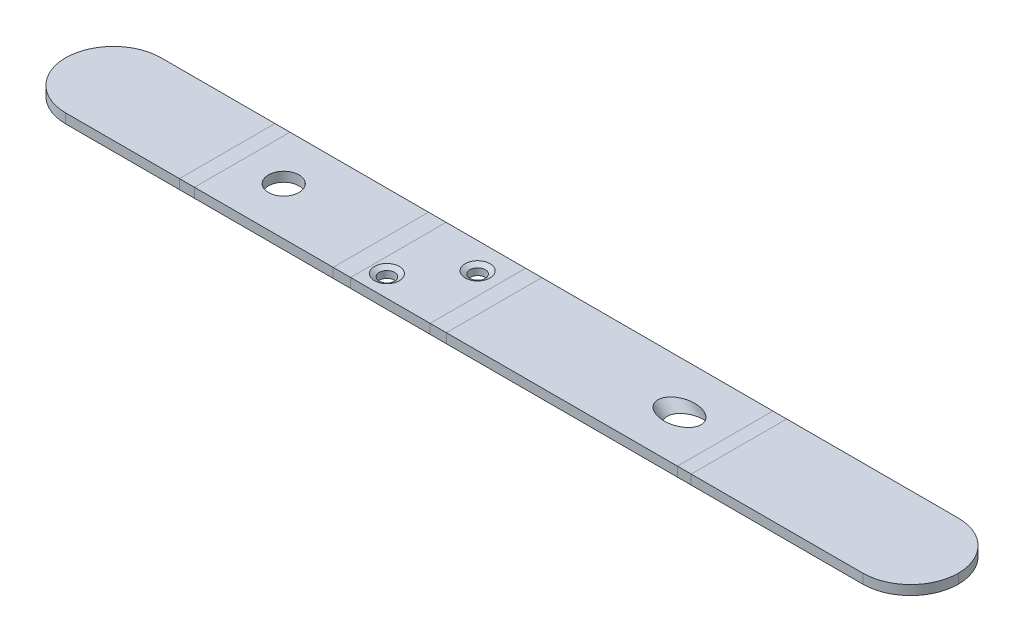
ISO-10303-21;
HEADER;
FILE_DESCRIPTION(('STEP AP214'),'2;1');
FILE_NAME('part.step','',(''),(''),'','','');
FILE_SCHEMA(('AUTOMOTIVE_DESIGN { 1 0 10303 214 1 1 1 1 }'));
ENDSEC;
DATA;
#1=APPLICATION_CONTEXT('core data for automotive mechanical design processes');
#2=APPLICATION_PROTOCOL_DEFINITION('international standard','automotive_design',2000,#1);
#3=PRODUCT_CONTEXT('',#1,'mechanical');
#4=PRODUCT('Part','Part','',(#3));
#5=PRODUCT_RELATED_PRODUCT_CATEGORY('part','',(#4));
#6=PRODUCT_DEFINITION_FORMATION('','',#4);
#7=PRODUCT_DEFINITION_CONTEXT('part definition',#1,'design');
#8=PRODUCT_DEFINITION('design','',#6,#7);
#9=PRODUCT_DEFINITION_SHAPE('','',#8);
#10=(LENGTH_UNIT() NAMED_UNIT(*) SI_UNIT(.MILLI.,.METRE.));
#11=(NAMED_UNIT(*) PLANE_ANGLE_UNIT() SI_UNIT($,.RADIAN.));
#12=(NAMED_UNIT(*) SI_UNIT($,.STERADIAN.) SOLID_ANGLE_UNIT());
#13=UNCERTAINTY_MEASURE_WITH_UNIT(LENGTH_MEASURE(1.E-05),#10,'distance_accuracy_value','');
#14=(GEOMETRIC_REPRESENTATION_CONTEXT(3) GLOBAL_UNCERTAINTY_ASSIGNED_CONTEXT((#13)) GLOBAL_UNIT_ASSIGNED_CONTEXT((#10,
#11,#12)) REPRESENTATION_CONTEXT('',''));
#15=CARTESIAN_POINT('',(0.,0.,0.));
#16=DIRECTION('',(0.,0.,1.));
#17=DIRECTION('',(1.,0.,0.));
#18=AXIS2_PLACEMENT_3D('',#15,#16,#17);
#19=CARTESIAN_POINT('',(0.,0.,20.));
#20=DIRECTION('',(0.,-1.,0.));
#21=DIRECTION('',(1.,0.,0.));
#22=AXIS2_PLACEMENT_3D('',#19,#20,#21);
#23=PLANE('',#22);
#24=CARTESIAN_POINT('',(-7.09958492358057,0.,5.5));
#25=DIRECTION('',(0.,1.,0.));
#26=DIRECTION('',(-1.,0.,0.));
#27=AXIS2_PLACEMENT_3D('',#24,#25,#26);
#28=CIRCLE('',#27,1.6);
#29=CARTESIAN_POINT('',(-8.69958492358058,0.,5.5));
#30=VERTEX_POINT('',#29);
#31=EDGE_CURVE('E392',#30,#30,#28,.T.);
#32=ORIENTED_EDGE('',*,*,#31,.T.);
#33=EDGE_LOOP('',(#32));
#34=FACE_BOUND('',#33,.T.);
#35=CARTESIAN_POINT('',(-16.0995849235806,0.,15.5));
#36=DIRECTION('',(0.,1.,0.));
#37=DIRECTION('',(-1.,0.,0.));
#38=AXIS2_PLACEMENT_3D('',#35,#36,#37);
#39=CIRCLE('',#38,1.6);
#40=CARTESIAN_POINT('',(-17.6995849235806,0.,15.5));
#41=VERTEX_POINT('',#40);
#42=EDGE_CURVE('E395',#41,#41,#39,.T.);
#43=ORIENTED_EDGE('',*,*,#42,.T.);
#44=EDGE_LOOP('',(#43));
#45=FACE_BOUND('',#44,.T.);
#46=DIRECTION('',(-1.,0.,0.));
#47=VECTOR('',#46,1.);
#48=CARTESIAN_POINT('',(0.,0.,20.));
#49=LINE('',#48,#47);
#50=CARTESIAN_POINT('',(-2.54828104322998,0.,20.));
#51=VERTEX_POINT('',#50);
#52=CARTESIAN_POINT('',(-19.1991698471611,0.,20.));
#53=VERTEX_POINT('',#52);
#54=EDGE_CURVE('E401',#51,#53,#49,.T.);
#55=ORIENTED_EDGE('',*,*,#54,.T.);
#56=DIRECTION('',(0.,0.,-1.));
#57=VECTOR('',#56,1.);
#58=CARTESIAN_POINT('',(-19.1991698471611,0.,0.));
#59=LINE('',#58,#57);
#60=CARTESIAN_POINT('',(-19.1991698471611,0.,0.));
#61=VERTEX_POINT('',#60);
#62=EDGE_CURVE('E420',#53,#61,#59,.T.);
#63=ORIENTED_EDGE('',*,*,#62,.T.);
#64=DIRECTION('',(-1.,0.,0.));
#65=VECTOR('',#64,1.);
#66=CARTESIAN_POINT('',(0.,0.,0.));
#67=LINE('',#66,#65);
#68=CARTESIAN_POINT('',(-2.54828104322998,0.,0.));
#69=VERTEX_POINT('',#68);
#70=EDGE_CURVE('E398',#69,#61,#67,.T.);
#71=ORIENTED_EDGE('',*,*,#70,.F.);
#72=DIRECTION('',(0.,0.,1.));
#73=VECTOR('',#72,1.);
#74=CARTESIAN_POINT('',(-2.54828104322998,0.,20.));
#75=LINE('',#74,#73);
#76=EDGE_CURVE('E430',#69,#51,#75,.T.);
#77=ORIENTED_EDGE('',*,*,#76,.T.);
#78=EDGE_LOOP('',(#55,#63,#71,#77));
#79=FACE_BOUND('',#78,.T.);
#80=ADVANCED_FACE('F40',(#34,#45,#79),#23,.T.);
#81=CARTESIAN_POINT('',(0.,2.,20.));
#82=DIRECTION('',(0.,-1.,0.));
#83=DIRECTION('',(1.,0.,0.));
#84=AXIS2_PLACEMENT_3D('',#81,#82,#83);
#85=PLANE('',#84);
#86=CARTESIAN_POINT('',(-16.0995849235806,2.,15.5));
#87=DIRECTION('',(0.,-1.,0.));
#88=DIRECTION('',(1.,0.,0.));
#89=AXIS2_PLACEMENT_3D('',#86,#87,#88);
#90=CIRCLE('',#89,2.60000000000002);
#91=CARTESIAN_POINT('',(-13.4995849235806,2.,15.5));
#92=VERTEX_POINT('',#91);
#93=EDGE_CURVE('E410',#92,#92,#90,.T.);
#94=ORIENTED_EDGE('',*,*,#93,.T.);
#95=EDGE_LOOP('',(#94));
#96=FACE_BOUND('',#95,.T.);
#97=CARTESIAN_POINT('',(-7.09958492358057,2.,5.5));
#98=DIRECTION('',(0.,-1.,0.));
#99=DIRECTION('',(1.,0.,0.));
#100=AXIS2_PLACEMENT_3D('',#97,#98,#99);
#101=CIRCLE('',#100,2.59999999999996);
#102=CARTESIAN_POINT('',(-4.49958492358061,2.,5.5));
#103=VERTEX_POINT('',#102);
#104=EDGE_CURVE('E407',#103,#103,#101,.T.);
#105=ORIENTED_EDGE('',*,*,#104,.T.);
#106=EDGE_LOOP('',(#105));
#107=FACE_BOUND('',#106,.T.);
#108=DIRECTION('',(0.,0.,-1.));
#109=VECTOR('',#108,1.);
#110=CARTESIAN_POINT('',(-19.1991698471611,2.,0.));
#111=LINE('',#110,#109);
#112=CARTESIAN_POINT('',(-19.1991698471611,1.99999998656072,20.));
#113=VERTEX_POINT('',#112);
#114=CARTESIAN_POINT('',(-19.1991698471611,1.99999998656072,0.));
#115=VERTEX_POINT('',#114);
#116=EDGE_CURVE('E416',#113,#115,#111,.T.);
#117=ORIENTED_EDGE('',*,*,#116,.F.);
#118=DIRECTION('',(-1.,0.,0.));
#119=VECTOR('',#118,1.);
#120=CARTESIAN_POINT('',(0.,2.,20.));
#121=LINE('',#120,#119);
#122=CARTESIAN_POINT('',(-2.54828104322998,2.00000000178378,20.));
#123=VERTEX_POINT('',#122);
#124=EDGE_CURVE('E389',#123,#113,#121,.T.);
#125=ORIENTED_EDGE('',*,*,#124,.F.);
#126=DIRECTION('',(0.,0.,1.));
#127=VECTOR('',#126,1.);
#128=CARTESIAN_POINT('',(-2.54828104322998,2.,20.));
#129=LINE('',#128,#127);
#130=CARTESIAN_POINT('',(-2.54828104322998,2.00000000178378,0.));
#131=VERTEX_POINT('',#130);
#132=EDGE_CURVE('E426',#131,#123,#129,.T.);
#133=ORIENTED_EDGE('',*,*,#132,.F.);
#134=DIRECTION('',(-1.,0.,0.));
#135=VECTOR('',#134,1.);
#136=CARTESIAN_POINT('',(0.,2.,0.));
#137=LINE('',#136,#135);
#138=EDGE_CURVE('E386',#131,#115,#137,.T.);
#139=ORIENTED_EDGE('',*,*,#138,.T.);
#140=EDGE_LOOP('',(#117,#125,#133,#139));
#141=FACE_BOUND('',#140,.T.);
#142=ADVANCED_FACE('F492',(#96,#107,#141),#85,.F.);
#143=CARTESIAN_POINT('',(-16.0995849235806,0.,15.5));
#144=DIRECTION('',(0.,1.,0.));
#145=DIRECTION('',(-1.,0.,0.));
#146=AXIS2_PLACEMENT_3D('',#143,#144,#145);
#147=CYLINDRICAL_SURFACE('',#146,1.6);
#148=CARTESIAN_POINT('',(-16.0995849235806,1.42264973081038,15.5));
#149=DIRECTION('',(0.,-1.,0.));
#150=DIRECTION('',(0.,0.,-1.));
#151=AXIS2_PLACEMENT_3D('',#148,#149,#150);
#152=CIRCLE('',#151,1.6);
#153=CARTESIAN_POINT('',(-16.0995849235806,1.42264973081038,13.9));
#154=VERTEX_POINT('',#153);
#155=EDGE_CURVE('E404',#154,#154,#152,.F.);
#156=ORIENTED_EDGE('',*,*,#155,.T.);
#157=EDGE_LOOP('',(#156));
#158=FACE_BOUND('',#157,.T.);
#159=ORIENTED_EDGE('',*,*,#42,.F.);
#160=EDGE_LOOP('',(#159));
#161=FACE_BOUND('',#160,.T.);
#162=ADVANCED_FACE('F573',(#158,#161),#147,.F.);
#163=CARTESIAN_POINT('',(-7.09958492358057,0.,5.5));
#164=DIRECTION('',(0.,1.,0.));
#165=DIRECTION('',(-1.,0.,0.));
#166=AXIS2_PLACEMENT_3D('',#163,#164,#165);
#167=CYLINDRICAL_SURFACE('',#166,1.6);
#168=CARTESIAN_POINT('',(-7.09958492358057,1.4226497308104,5.5));
#169=DIRECTION('',(0.,-1.,0.));
#170=DIRECTION('',(0.,0.,-1.));
#171=AXIS2_PLACEMENT_3D('',#168,#169,#170);
#172=CIRCLE('',#171,1.6);
#173=CARTESIAN_POINT('',(-7.09958492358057,1.4226497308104,3.9));
#174=VERTEX_POINT('',#173);
#175=EDGE_CURVE('E413',#174,#174,#172,.F.);
#176=ORIENTED_EDGE('',*,*,#175,.T.);
#177=EDGE_LOOP('',(#176));
#178=FACE_BOUND('',#177,.T.);
#179=ORIENTED_EDGE('',*,*,#31,.F.);
#180=EDGE_LOOP('',(#179));
#181=FACE_BOUND('',#180,.T.);
#182=ADVANCED_FACE('F576',(#178,#181),#167,.F.);
#183=CARTESIAN_POINT('',(0.,54.0481353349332,0.));
#184=DIRECTION('',(0.,0.,1.));
#185=DIRECTION('',(1.,0.,0.));
#186=AXIS2_PLACEMENT_3D('',#183,#184,#185);
#187=PLANE('',#186);
#188=ORIENTED_EDGE('',*,*,#70,.T.);
#189=DIRECTION('',(0.,-1.,0.));
#190=VECTOR('',#189,1.);
#191=CARTESIAN_POINT('',(-19.1991698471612,54.0481353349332,0.));
#192=LINE('',#191,#190);
#193=EDGE_CURVE('E418',#115,#61,#192,.T.);
#194=ORIENTED_EDGE('',*,*,#193,.F.);
#195=ORIENTED_EDGE('',*,*,#138,.F.);
#196=DIRECTION('',(0.,-1.,0.));
#197=VECTOR('',#196,1.);
#198=CARTESIAN_POINT('',(-2.54828104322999,54.0481353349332,0.));
#199=LINE('',#198,#197);
#200=EDGE_CURVE('E433',#131,#69,#199,.T.);
#201=ORIENTED_EDGE('',*,*,#200,.T.);
#202=EDGE_LOOP('',(#188,#194,#195,#201));
#203=FACE_BOUND('',#202,.T.);
#204=ADVANCED_FACE('F42',(#203),#187,.F.);
#205=CARTESIAN_POINT('',(0.,54.0481353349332,20.));
#206=DIRECTION('',(0.,0.,1.));
#207=DIRECTION('',(1.,0.,0.));
#208=AXIS2_PLACEMENT_3D('',#205,#206,#207);
#209=PLANE('',#208);
#210=DIRECTION('',(0.,-1.,0.));
#211=VECTOR('',#210,1.);
#212=CARTESIAN_POINT('',(-19.1991698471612,54.0481353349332,20.));
#213=LINE('',#212,#211);
#214=EDGE_CURVE('E423',#113,#53,#213,.T.);
#215=ORIENTED_EDGE('',*,*,#214,.T.);
#216=ORIENTED_EDGE('',*,*,#54,.F.);
#217=DIRECTION('',(0.,-1.,0.));
#218=VECTOR('',#217,1.);
#219=CARTESIAN_POINT('',(-2.54828104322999,54.0481353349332,20.));
#220=LINE('',#219,#218);
#221=EDGE_CURVE('E428',#123,#51,#220,.T.);
#222=ORIENTED_EDGE('',*,*,#221,.F.);
#223=ORIENTED_EDGE('',*,*,#124,.T.);
#224=EDGE_LOOP('',(#215,#216,#222,#223));
#225=FACE_BOUND('',#224,.T.);
#226=ADVANCED_FACE('F477',(#225),#209,.T.);
#227=CARTESIAN_POINT('',(-16.0995849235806,1.42264973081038,15.5));
#228=DIRECTION('',(0.,1.,0.));
#229=DIRECTION('',(0.,0.,1.));
#230=AXIS2_PLACEMENT_3D('',#227,#228,#229);
#231=CONICAL_SURFACE('',#230,1.6,1.04719755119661);
#232=ORIENTED_EDGE('',*,*,#93,.F.);
#233=EDGE_LOOP('',(#232));
#234=FACE_BOUND('',#233,.T.);
#235=ORIENTED_EDGE('',*,*,#155,.F.);
#236=EDGE_LOOP('',(#235));
#237=FACE_BOUND('',#236,.T.);
#238=ADVANCED_FACE('F583',(#234,#237),#231,.F.);
#239=CARTESIAN_POINT('',(-7.09958492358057,1.4226497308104,5.5));
#240=DIRECTION('',(0.,1.,0.));
#241=DIRECTION('',(0.,0.,1.));
#242=AXIS2_PLACEMENT_3D('',#239,#240,#241);
#243=CONICAL_SURFACE('',#242,1.6,1.04719755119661);
#244=ORIENTED_EDGE('',*,*,#104,.F.);
#245=EDGE_LOOP('',(#244));
#246=FACE_BOUND('',#245,.T.);
#247=ORIENTED_EDGE('',*,*,#175,.F.);
#248=EDGE_LOOP('',(#247));
#249=FACE_BOUND('',#248,.T.);
#250=ADVANCED_FACE('F589',(#246,#249),#243,.F.);
#251=CARTESIAN_POINT('',(-19.1991698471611,1.99999998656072,0.));
#252=DIRECTION('',(0.,0.,-1.));
#253=DIRECTION('',(-1.,0.,0.));
#254=AXIS2_PLACEMENT_3D('',#251,#252,#253);
#255=PLANE('',#254);
#256=ORIENTED_EDGE('',*,*,#193,.T.);
#257=DIRECTION('',(-1.,0.,0.));
#258=VECTOR('',#257,1.);
#259=CARTESIAN_POINT('',(-21.0317655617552,0.,0.));
#260=LINE('',#259,#258);
#261=CARTESIAN_POINT('',(-22.8643612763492,-1.3439284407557E-08,8.84278526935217E-10));
#262=VERTEX_POINT('',#261);
#263=EDGE_CURVE('E291',#61,#262,#260,.T.);
#264=ORIENTED_EDGE('',*,*,#263,.T.);
#265=DIRECTION('',(0.,-1.,0.));
#266=VECTOR('',#265,1.);
#267=CARTESIAN_POINT('',(-22.8643612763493,72.5288932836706,8.84278526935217E-10));
#268=LINE('',#267,#266);
#269=CARTESIAN_POINT('',(-22.8643612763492,1.99999998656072,8.84278526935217E-10));
#270=VERTEX_POINT('',#269);
#271=EDGE_CURVE('E300',#270,#262,#268,.T.);
#272=ORIENTED_EDGE('',*,*,#271,.F.);
#273=DIRECTION('',(-1.,0.,0.));
#274=VECTOR('',#273,1.);
#275=CARTESIAN_POINT('',(-19.1991698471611,1.99999998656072,0.));
#276=LINE('',#275,#274);
#277=EDGE_CURVE('E380',#115,#270,#276,.T.);
#278=ORIENTED_EDGE('',*,*,#277,.F.);
#279=EDGE_LOOP('',(#256,#264,#272,#278));
#280=FACE_BOUND('',#279,.T.);
#281=ADVANCED_FACE('F500',(#280),#255,.T.);
#282=CARTESIAN_POINT('',(-22.8643612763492,1.99999998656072,20.));
#283=DIRECTION('',(0.,0.,1.));
#284=DIRECTION('',(1.,0.,0.));
#285=AXIS2_PLACEMENT_3D('',#282,#283,#284);
#286=PLANE('',#285);
#287=DIRECTION('',(-1.,0.,0.));
#288=VECTOR('',#287,1.);
#289=CARTESIAN_POINT('',(-21.0317655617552,0.,20.));
#290=LINE('',#289,#288);
#291=CARTESIAN_POINT('',(-22.8643612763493,-1.3439287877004E-08,20.0000000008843));
#292=VERTEX_POINT('',#291);
#293=EDGE_CURVE('E378',#292,#53,#290,.F.);
#294=ORIENTED_EDGE('',*,*,#293,.T.);
#295=ORIENTED_EDGE('',*,*,#214,.F.);
#296=DIRECTION('',(1.,0.,0.));
#297=VECTOR('',#296,1.);
#298=CARTESIAN_POINT('',(-22.8643612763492,1.99999998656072,20.));
#299=LINE('',#298,#297);
#300=CARTESIAN_POINT('',(-22.8643612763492,1.99999998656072,20.));
#301=VERTEX_POINT('',#300);
#302=EDGE_CURVE('E383',#301,#113,#299,.T.);
#303=ORIENTED_EDGE('',*,*,#302,.F.);
#304=DIRECTION('',(0.,-1.,0.));
#305=VECTOR('',#304,1.);
#306=CARTESIAN_POINT('',(-22.8643612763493,72.5288932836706,20.0000000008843));
#307=LINE('',#306,#305);
#308=EDGE_CURVE('E287',#301,#292,#307,.T.);
#309=ORIENTED_EDGE('',*,*,#308,.T.);
#310=EDGE_LOOP('',(#294,#295,#303,#309));
#311=FACE_BOUND('',#310,.T.);
#312=ADVANCED_FACE('F516',(#311),#286,.T.);
#313=CARTESIAN_POINT('',(-21.0317655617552,2.,10.));
#314=DIRECTION('',(0.,1.,0.));
#315=DIRECTION('',(-1.,0.,0.));
#316=AXIS2_PLACEMENT_3D('',#313,#314,#315);
#317=PLANE('',#316);
#318=DIRECTION('',(0.,0.,-1.));
#319=VECTOR('',#318,1.);
#320=CARTESIAN_POINT('',(-22.8643612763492,1.99999998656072,8.84278526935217E-10));
#321=LINE('',#320,#319);
#322=EDGE_CURVE('E306',#301,#270,#321,.T.);
#323=ORIENTED_EDGE('',*,*,#322,.F.);
#324=ORIENTED_EDGE('',*,*,#302,.T.);
#325=ORIENTED_EDGE('',*,*,#116,.T.);
#326=ORIENTED_EDGE('',*,*,#277,.T.);
#327=EDGE_LOOP('',(#323,#324,#325,#326));
#328=FACE_BOUND('',#327,.T.);
#329=ADVANCED_FACE('F496',(#328),#317,.T.);
#330=CARTESIAN_POINT('',(-21.0317655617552,0.,10.));
#331=DIRECTION('',(0.,1.,0.));
#332=DIRECTION('',(-1.,0.,0.));
#333=AXIS2_PLACEMENT_3D('',#330,#331,#332);
#334=PLANE('',#333);
#335=DIRECTION('',(0.,0.,-1.));
#336=VECTOR('',#335,1.);
#337=CARTESIAN_POINT('',(-22.8643612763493,-1.3439287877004E-08,8.84278526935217E-10));
#338=LINE('',#337,#336);
#339=EDGE_CURVE('E371',#292,#262,#338,.T.);
#340=ORIENTED_EDGE('',*,*,#339,.T.);
#341=ORIENTED_EDGE('',*,*,#263,.F.);
#342=ORIENTED_EDGE('',*,*,#62,.F.);
#343=ORIENTED_EDGE('',*,*,#293,.F.);
#344=EDGE_LOOP('',(#340,#341,#342,#343));
#345=FACE_BOUND('',#344,.T.);
#346=ADVANCED_FACE('F511',(#345),#334,.F.);
#347=CARTESIAN_POINT('',(-78.8957227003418,-76.625804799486,10.0000000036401));
#348=DIRECTION('',(0.,1.,0.));
#349=DIRECTION('',(-1.,0.,0.));
#350=AXIS2_PLACEMENT_3D('',#347,#348,#349);
#351=CYLINDRICAL_SURFACE('',#350,10.);
#352=DIRECTION('',(0.,1.,0.));
#353=VECTOR('',#352,1.);
#354=CARTESIAN_POINT('',(-78.8957227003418,-76.625804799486,20.0000000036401));
#355=LINE('',#354,#353);
#356=CARTESIAN_POINT('',(-78.8957227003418,1.41192543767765E-08,20.0000000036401));
#357=VERTEX_POINT('',#356);
#358=CARTESIAN_POINT('',(-78.8957227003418,2.00000001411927,20.0000000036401));
#359=VERTEX_POINT('',#358);
#360=EDGE_CURVE('E368',#357,#359,#355,.T.);
#361=ORIENTED_EDGE('',*,*,#360,.T.);
#362=CARTESIAN_POINT('',(-78.8957227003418,2.00000001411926,10.0000000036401));
#363=DIRECTION('',(0.,-1.,0.));
#364=DIRECTION('',(1.,0.,0.));
#365=AXIS2_PLACEMENT_3D('',#362,#363,#364);
#366=CIRCLE('',#365,10.);
#367=CARTESIAN_POINT('',(-88.8957227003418,2.00000001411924,10.0000000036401));
#368=VERTEX_POINT('',#367);
#369=EDGE_CURVE('E339',#368,#359,#366,.F.);
#370=ORIENTED_EDGE('',*,*,#369,.F.);
#371=DIRECTION('',(0.,1.,0.));
#372=VECTOR('',#371,1.);
#373=CARTESIAN_POINT('',(-88.8957227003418,-76.625804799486,10.0000000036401));
#374=LINE('',#373,#372);
#375=CARTESIAN_POINT('',(-88.8957227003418,1.41192543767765E-08,10.0000000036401));
#376=VERTEX_POINT('',#375);
#377=EDGE_CURVE('E365',#376,#368,#374,.T.);
#378=ORIENTED_EDGE('',*,*,#377,.F.);
#379=CARTESIAN_POINT('',(-78.8957227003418,1.41192439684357E-08,10.0000000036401));
#380=DIRECTION('',(0.,-1.,0.));
#381=DIRECTION('',(1.,0.,0.));
#382=AXIS2_PLACEMENT_3D('',#379,#380,#381);
#383=CIRCLE('',#382,10.);
#384=EDGE_CURVE('E357',#357,#376,#383,.T.);
#385=ORIENTED_EDGE('',*,*,#384,.F.);
#386=EDGE_LOOP('',(#361,#370,#378,#385));
#387=FACE_BOUND('',#386,.T.);
#388=ADVANCED_FACE('F554',(#387),#351,.T.);
#389=CARTESIAN_POINT('',(-78.8957227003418,-76.625804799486,10.0000000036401));
#390=DIRECTION('',(0.,1.,0.));
#391=DIRECTION('',(-1.,0.,0.));
#392=AXIS2_PLACEMENT_3D('',#389,#390,#391);
#393=CYLINDRICAL_SURFACE('',#392,10.);
#394=ORIENTED_EDGE('',*,*,#377,.T.);
#395=CARTESIAN_POINT('',(-78.8957227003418,2.00000001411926,10.0000000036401));
#396=DIRECTION('',(0.,-1.,0.));
#397=DIRECTION('',(1.,0.,0.));
#398=AXIS2_PLACEMENT_3D('',#395,#396,#397);
#399=CIRCLE('',#398,10.);
#400=CARTESIAN_POINT('',(-78.8957227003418,2.00000001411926,3.64012240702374E-09));
#401=VERTEX_POINT('',#400);
#402=EDGE_CURVE('E342',#401,#368,#399,.F.);
#403=ORIENTED_EDGE('',*,*,#402,.F.);
#404=DIRECTION('',(0.,1.,0.));
#405=VECTOR('',#404,1.);
#406=CARTESIAN_POINT('',(-78.8957227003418,-76.625804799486,3.64012240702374E-09));
#407=LINE('',#406,#405);
#408=CARTESIAN_POINT('',(-78.8957227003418,1.41192509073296E-08,3.64012240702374E-09));
#409=VERTEX_POINT('',#408);
#410=EDGE_CURVE('E350',#409,#401,#407,.T.);
#411=ORIENTED_EDGE('',*,*,#410,.F.);
#412=CARTESIAN_POINT('',(-78.8957227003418,1.41192439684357E-08,10.0000000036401));
#413=DIRECTION('',(0.,-1.,0.));
#414=DIRECTION('',(1.,0.,0.));
#415=AXIS2_PLACEMENT_3D('',#412,#413,#414);
#416=CIRCLE('',#415,10.);
#417=EDGE_CURVE('E355',#376,#409,#416,.T.);
#418=ORIENTED_EDGE('',*,*,#417,.F.);
#419=EDGE_LOOP('',(#394,#403,#411,#418));
#420=FACE_BOUND('',#419,.T.);
#421=ADVANCED_FACE('F557',(#420),#393,.T.);
#422=CARTESIAN_POINT('',(-53.8957227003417,-76.625804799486,20.0000000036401));
#423=DIRECTION('',(0.,0.,-1.));
#424=DIRECTION('',(-1.,0.,0.));
#425=AXIS2_PLACEMENT_3D('',#422,#423,#424);
#426=PLANE('',#425);
#427=DIRECTION('',(0.,1.,0.));
#428=VECTOR('',#427,1.);
#429=CARTESIAN_POINT('',(-55.050423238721,-76.625804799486,20.0000000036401));
#430=LINE('',#429,#428);
#431=CARTESIAN_POINT('',(-55.050423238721,1.41192647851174E-08,20.0000000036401));
#432=VERTEX_POINT('',#431);
#433=CARTESIAN_POINT('',(-55.050423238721,2.00000001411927,20.0000000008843));
#434=VERTEX_POINT('',#433);
#435=EDGE_CURVE('E363',#432,#434,#430,.T.);
#436=ORIENTED_EDGE('',*,*,#435,.T.);
#437=DIRECTION('',(-1.,0.,0.));
#438=VECTOR('',#437,1.);
#439=CARTESIAN_POINT('',(-53.8957227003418,2.00000001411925,20.0000000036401));
#440=LINE('',#439,#438);
#441=EDGE_CURVE('E361',#434,#359,#440,.T.);
#442=ORIENTED_EDGE('',*,*,#441,.T.);
#443=ORIENTED_EDGE('',*,*,#360,.F.);
#444=DIRECTION('',(-1.,0.,0.));
#445=VECTOR('',#444,1.);
#446=CARTESIAN_POINT('',(-53.8957227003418,1.41192613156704E-08,20.0000000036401));
#447=LINE('',#446,#445);
#448=EDGE_CURVE('E359',#432,#357,#447,.T.);
#449=ORIENTED_EDGE('',*,*,#448,.F.);
#450=EDGE_LOOP('',(#436,#442,#443,#449));
#451=FACE_BOUND('',#450,.T.);
#452=ADVANCED_FACE('F547',(#451),#426,.F.);
#453=CARTESIAN_POINT('',(-53.8957227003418,1.41192613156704E-08,20.0000000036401));
#454=DIRECTION('',(0.,-1.,0.));
#455=DIRECTION('',(1.,0.,0.));
#456=AXIS2_PLACEMENT_3D('',#453,#454,#455);
#457=PLANE('',#456);
#458=DIRECTION('',(0.,0.,-1.));
#459=VECTOR('',#458,1.);
#460=CARTESIAN_POINT('',(-55.050423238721,1.41192370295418E-08,20.0000000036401));
#461=LINE('',#460,#459);
#462=CARTESIAN_POINT('',(-55.050423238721,1.41192647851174E-08,3.64012240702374E-09));
#463=VERTEX_POINT('',#462);
#464=EDGE_CURVE('E331',#432,#463,#461,.T.);
#465=ORIENTED_EDGE('',*,*,#464,.F.);
#466=ORIENTED_EDGE('',*,*,#448,.T.);
#467=ORIENTED_EDGE('',*,*,#384,.T.);
#468=ORIENTED_EDGE('',*,*,#417,.T.);
#469=DIRECTION('',(-1.,0.,0.));
#470=VECTOR('',#469,1.);
#471=CARTESIAN_POINT('',(-53.8957227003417,1.41192370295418E-08,3.64012240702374E-09));
#472=LINE('',#471,#470);
#473=EDGE_CURVE('E352',#463,#409,#472,.T.);
#474=ORIENTED_EDGE('',*,*,#473,.F.);
#475=EDGE_LOOP('',(#465,#466,#467,#468,#474));
#476=FACE_BOUND('',#475,.T.);
#477=ADVANCED_FACE('F541',(#476),#457,.T.);
#478=CARTESIAN_POINT('',(-53.8957227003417,-76.625804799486,3.64012240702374E-09));
#479=DIRECTION('',(0.,0.,-1.));
#480=DIRECTION('',(-1.,0.,0.));
#481=AXIS2_PLACEMENT_3D('',#478,#479,#480);
#482=PLANE('',#481);
#483=DIRECTION('',(-1.,0.,0.));
#484=VECTOR('',#483,1.);
#485=CARTESIAN_POINT('',(-53.8957227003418,2.00000001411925,3.64012240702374E-09));
#486=LINE('',#485,#484);
#487=CARTESIAN_POINT('',(-55.050423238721,2.00000001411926,3.64012240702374E-09));
#488=VERTEX_POINT('',#487);
#489=EDGE_CURVE('E345',#488,#401,#486,.T.);
#490=ORIENTED_EDGE('',*,*,#489,.F.);
#491=DIRECTION('',(0.,1.,0.));
#492=VECTOR('',#491,1.);
#493=CARTESIAN_POINT('',(-55.050423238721,-76.625804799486,3.64012240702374E-09));
#494=LINE('',#493,#492);
#495=EDGE_CURVE('E325',#463,#488,#494,.T.);
#496=ORIENTED_EDGE('',*,*,#495,.F.);
#497=ORIENTED_EDGE('',*,*,#473,.T.);
#498=ORIENTED_EDGE('',*,*,#410,.T.);
#499=EDGE_LOOP('',(#490,#496,#497,#498));
#500=FACE_BOUND('',#499,.T.);
#501=ADVANCED_FACE('F533',(#500),#482,.T.);
#502=CARTESIAN_POINT('',(-53.8957227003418,2.00000001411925,20.0000000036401));
#503=DIRECTION('',(0.,-1.,0.));
#504=DIRECTION('',(1.,0.,0.));
#505=AXIS2_PLACEMENT_3D('',#502,#503,#504);
#506=PLANE('',#505);
#507=ORIENTED_EDGE('',*,*,#441,.F.);
#508=DIRECTION('',(0.,0.,-1.));
#509=VECTOR('',#508,1.);
#510=CARTESIAN_POINT('',(-55.050423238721,2.00000001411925,20.0000000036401));
#511=LINE('',#510,#509);
#512=EDGE_CURVE('E348',#434,#488,#511,.T.);
#513=ORIENTED_EDGE('',*,*,#512,.T.);
#514=ORIENTED_EDGE('',*,*,#489,.T.);
#515=ORIENTED_EDGE('',*,*,#402,.T.);
#516=ORIENTED_EDGE('',*,*,#369,.T.);
#517=EDGE_LOOP('',(#507,#513,#514,#515,#516));
#518=FACE_BOUND('',#517,.T.);
#519=ADVANCED_FACE('F550',(#518),#506,.F.);
#520=CARTESIAN_POINT('',(-55.050423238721,2.00000001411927,20.0000000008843));
#521=DIRECTION('',(0.,0.,1.));
#522=DIRECTION('',(1.,0.,0.));
#523=AXIS2_PLACEMENT_3D('',#520,#521,#522);
#524=PLANE('',#523);
#525=ORIENTED_EDGE('',*,*,#435,.F.);
#526=DIRECTION('',(-1.,0.,0.));
#527=VECTOR('',#526,1.);
#528=CARTESIAN_POINT('',(-53.4796269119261,-1.34392774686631E-08,20.0000000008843));
#529=LINE('',#528,#527);
#530=CARTESIAN_POINT('',(-51.9088305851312,-1.3439284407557E-08,20.0000000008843));
#531=VERTEX_POINT('',#530);
#532=EDGE_CURVE('E337',#432,#531,#529,.F.);
#533=ORIENTED_EDGE('',*,*,#532,.T.);
#534=DIRECTION('',(0.,-1.,0.));
#535=VECTOR('',#534,1.);
#536=CARTESIAN_POINT('',(-51.9088305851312,72.5288932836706,20.0000000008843));
#537=LINE('',#536,#535);
#538=CARTESIAN_POINT('',(-51.9088305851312,2.00000001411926,20.0000000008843));
#539=VERTEX_POINT('',#538);
#540=EDGE_CURVE('E292',#539,#531,#537,.T.);
#541=ORIENTED_EDGE('',*,*,#540,.F.);
#542=DIRECTION('',(1.,0.,0.));
#543=VECTOR('',#542,1.);
#544=CARTESIAN_POINT('',(-55.050423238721,2.00000001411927,20.0000000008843));
#545=LINE('',#544,#543);
#546=EDGE_CURVE('E317',#434,#539,#545,.T.);
#547=ORIENTED_EDGE('',*,*,#546,.F.);
#548=EDGE_LOOP('',(#525,#533,#541,#547));
#549=FACE_BOUND('',#548,.T.);
#550=ADVANCED_FACE('F544',(#549),#524,.T.);
#551=CARTESIAN_POINT('',(-53.4796269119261,-1.34392774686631E-08,10.0000000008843));
#552=DIRECTION('',(0.,1.,0.));
#553=DIRECTION('',(-1.,0.,0.));
#554=AXIS2_PLACEMENT_3D('',#551,#552,#553);
#555=PLANE('',#554);
#556=DIRECTION('',(0.,0.,1.));
#557=VECTOR('',#556,1.);
#558=CARTESIAN_POINT('',(-51.9088305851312,-1.3439284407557E-08,20.0000000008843));
#559=LINE('',#558,#557);
#560=CARTESIAN_POINT('',(-51.9088305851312,-1.34392774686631E-08,8.84279935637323E-10));
#561=VERTEX_POINT('',#560);
#562=EDGE_CURVE('E334',#561,#531,#559,.T.);
#563=ORIENTED_EDGE('',*,*,#562,.T.);
#564=ORIENTED_EDGE('',*,*,#532,.F.);
#565=ORIENTED_EDGE('',*,*,#464,.T.);
#566=DIRECTION('',(-1.,0.,0.));
#567=VECTOR('',#566,1.);
#568=CARTESIAN_POINT('',(-53.4796269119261,-1.34392774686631E-08,8.84279311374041E-10));
#569=LINE('',#568,#567);
#570=EDGE_CURVE('E328',#561,#463,#569,.T.);
#571=ORIENTED_EDGE('',*,*,#570,.F.);
#572=EDGE_LOOP('',(#563,#564,#565,#571));
#573=FACE_BOUND('',#572,.T.);
#574=ADVANCED_FACE('F538',(#573),#555,.F.);
#575=CARTESIAN_POINT('',(-51.9088305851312,2.00000001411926,8.84278200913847E-10));
#576=DIRECTION('',(0.,0.,-1.));
#577=DIRECTION('',(-1.,0.,0.));
#578=AXIS2_PLACEMENT_3D('',#575,#576,#577);
#579=PLANE('',#578);
#580=ORIENTED_EDGE('',*,*,#570,.T.);
#581=ORIENTED_EDGE('',*,*,#495,.T.);
#582=DIRECTION('',(-1.,0.,0.));
#583=VECTOR('',#582,1.);
#584=CARTESIAN_POINT('',(-51.9088305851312,2.00000001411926,8.84278200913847E-10));
#585=LINE('',#584,#583);
#586=CARTESIAN_POINT('',(-51.9088305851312,2.00000001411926,8.84278200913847E-10));
#587=VERTEX_POINT('',#586);
#588=EDGE_CURVE('E320',#587,#488,#585,.T.);
#589=ORIENTED_EDGE('',*,*,#588,.F.);
#590=DIRECTION('',(0.,-1.,0.));
#591=VECTOR('',#590,1.);
#592=CARTESIAN_POINT('',(-51.9088305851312,72.5288932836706,8.84278526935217E-10));
#593=LINE('',#592,#591);
#594=EDGE_CURVE('E323',#587,#561,#593,.T.);
#595=ORIENTED_EDGE('',*,*,#594,.T.);
#596=EDGE_LOOP('',(#580,#581,#589,#595));
#597=FACE_BOUND('',#596,.T.);
#598=ADVANCED_FACE('F528',(#597),#579,.T.);
#599=CARTESIAN_POINT('',(-53.4796269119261,1.99999998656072,10.0000000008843));
#600=DIRECTION('',(0.,1.,0.));
#601=DIRECTION('',(-1.,0.,0.));
#602=AXIS2_PLACEMENT_3D('',#599,#600,#601);
#603=PLANE('',#602);
#604=DIRECTION('',(0.,0.,1.));
#605=VECTOR('',#604,1.);
#606=CARTESIAN_POINT('',(-51.9088305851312,1.99999998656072,20.0000000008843));
#607=LINE('',#606,#605);
#608=EDGE_CURVE('E308',#587,#539,#607,.T.);
#609=ORIENTED_EDGE('',*,*,#608,.F.);
#610=ORIENTED_EDGE('',*,*,#588,.T.);
#611=ORIENTED_EDGE('',*,*,#512,.F.);
#612=ORIENTED_EDGE('',*,*,#546,.T.);
#613=EDGE_LOOP('',(#609,#610,#611,#612));
#614=FACE_BOUND('',#613,.T.);
#615=ADVANCED_FACE('F524',(#614),#603,.T.);
#616=CARTESIAN_POINT('',(-43.2182316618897,-58.0000000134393,10.0000000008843));
#617=DIRECTION('',(0.,1.,0.));
#618=DIRECTION('',(-1.,0.,0.));
#619=AXIS2_PLACEMENT_3D('',#616,#617,#618);
#620=CYLINDRICAL_SURFACE('',#619,3.2);
#621=CARTESIAN_POINT('',(-43.2182316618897,-1.3439284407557E-08,10.0000000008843));
#622=DIRECTION('',(0.,-1.,0.));
#623=DIRECTION('',(1.,0.,0.));
#624=AXIS2_PLACEMENT_3D('',#621,#622,#623);
#625=CIRCLE('',#624,3.2);
#626=CARTESIAN_POINT('',(-40.0182316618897,-1.34392848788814E-08,10.0000000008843));
#627=VERTEX_POINT('',#626);
#628=EDGE_CURVE('E314',#627,#627,#625,.T.);
#629=ORIENTED_EDGE('',*,*,#628,.T.);
#630=EDGE_LOOP('',(#629));
#631=FACE_BOUND('',#630,.T.);
#632=CARTESIAN_POINT('',(-43.2182316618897,1.99999998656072,10.0000000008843));
#633=DIRECTION('',(0.,-1.,0.));
#634=DIRECTION('',(1.,0.,0.));
#635=AXIS2_PLACEMENT_3D('',#632,#633,#634);
#636=CIRCLE('',#635,3.2);
#637=CARTESIAN_POINT('',(-40.0182316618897,1.99999998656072,10.0000000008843));
#638=VERTEX_POINT('',#637);
#639=EDGE_CURVE('E311',#638,#638,#636,.T.);
#640=ORIENTED_EDGE('',*,*,#639,.F.);
#641=EDGE_LOOP('',(#640));
#642=FACE_BOUND('',#641,.T.);
#643=ADVANCED_FACE('F624',(#631,#642),#620,.F.);
#644=CARTESIAN_POINT('',(-20.0635311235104,1.99999998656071,20.0000000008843));
#645=DIRECTION('',(0.,-1.,0.));
#646=DIRECTION('',(1.,0.,0.));
#647=AXIS2_PLACEMENT_3D('',#644,#645,#646);
#648=PLANE('',#647);
#649=ORIENTED_EDGE('',*,*,#639,.T.);
#650=EDGE_LOOP('',(#649));
#651=FACE_BOUND('',#650,.T.);
#652=DIRECTION('',(1.,0.,0.));
#653=VECTOR('',#652,1.);
#654=CARTESIAN_POINT('',(-20.0635311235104,1.99999998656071,8.84278526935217E-10));
#655=LINE('',#654,#653);
#656=EDGE_CURVE('E303',#587,#270,#655,.T.);
#657=ORIENTED_EDGE('',*,*,#656,.F.);
#658=ORIENTED_EDGE('',*,*,#608,.T.);
#659=DIRECTION('',(-1.,0.,0.));
#660=VECTOR('',#659,1.);
#661=CARTESIAN_POINT('',(-20.0635311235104,1.99999998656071,20.0000000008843));
#662=LINE('',#661,#660);
#663=EDGE_CURVE('E288',#301,#539,#662,.T.);
#664=ORIENTED_EDGE('',*,*,#663,.F.);
#665=ORIENTED_EDGE('',*,*,#322,.T.);
#666=EDGE_LOOP('',(#657,#658,#664,#665));
#667=FACE_BOUND('',#666,.T.);
#668=ADVANCED_FACE('F521',(#651,#667),#648,.F.);
#669=CARTESIAN_POINT('',(-20.0635311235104,72.5288932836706,8.84278526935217E-10));
#670=DIRECTION('',(0.,0.,1.));
#671=DIRECTION('',(1.,0.,0.));
#672=AXIS2_PLACEMENT_3D('',#669,#670,#671);
#673=PLANE('',#672);
#674=DIRECTION('',(1.,0.,0.));
#675=VECTOR('',#674,1.);
#676=CARTESIAN_POINT('',(-20.0635311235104,-1.3439287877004E-08,8.84278526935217E-10));
#677=LINE('',#676,#675);
#678=EDGE_CURVE('E298',#561,#262,#677,.T.);
#679=ORIENTED_EDGE('',*,*,#678,.F.);
#680=ORIENTED_EDGE('',*,*,#594,.F.);
#681=ORIENTED_EDGE('',*,*,#656,.T.);
#682=ORIENTED_EDGE('',*,*,#271,.T.);
#683=EDGE_LOOP('',(#679,#680,#681,#682));
#684=FACE_BOUND('',#683,.T.);
#685=ADVANCED_FACE('F504',(#684),#673,.F.);
#686=CARTESIAN_POINT('',(-20.0635311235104,-1.3439284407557E-08,20.0000000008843));
#687=DIRECTION('',(0.,-1.,0.));
#688=DIRECTION('',(1.,0.,0.));
#689=AXIS2_PLACEMENT_3D('',#686,#687,#688);
#690=PLANE('',#689);
#691=ORIENTED_EDGE('',*,*,#562,.F.);
#692=ORIENTED_EDGE('',*,*,#678,.T.);
#693=ORIENTED_EDGE('',*,*,#339,.F.);
#694=DIRECTION('',(-1.,0.,0.));
#695=VECTOR('',#694,1.);
#696=CARTESIAN_POINT('',(-20.0635311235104,-1.3439284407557E-08,20.0000000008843));
#697=LINE('',#696,#695);
#698=EDGE_CURVE('E295',#292,#531,#697,.T.);
#699=ORIENTED_EDGE('',*,*,#698,.T.);
#700=EDGE_LOOP('',(#691,#692,#693,#699));
#701=FACE_BOUND('',#700,.T.);
#702=ORIENTED_EDGE('',*,*,#628,.F.);
#703=EDGE_LOOP('',(#702));
#704=FACE_BOUND('',#703,.T.);
#705=ADVANCED_FACE('F513',(#701,#704),#690,.T.);
#706=CARTESIAN_POINT('',(-20.0635311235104,72.5288932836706,20.0000000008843));
#707=DIRECTION('',(0.,0.,1.));
#708=DIRECTION('',(1.,0.,0.));
#709=AXIS2_PLACEMENT_3D('',#706,#707,#708);
#710=PLANE('',#709);
#711=ORIENTED_EDGE('',*,*,#540,.T.);
#712=ORIENTED_EDGE('',*,*,#698,.F.);
#713=ORIENTED_EDGE('',*,*,#308,.F.);
#714=ORIENTED_EDGE('',*,*,#663,.T.);
#715=EDGE_LOOP('',(#711,#712,#713,#714));
#716=FACE_BOUND('',#715,.T.);
#717=ADVANCED_FACE('F519',(#716),#710,.T.);
#718=CARTESIAN_POINT('',(-2.54828104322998,2.00000000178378,20.));
#719=DIRECTION('',(0.,0.,1.));
#720=DIRECTION('',(1.,0.,0.));
#721=AXIS2_PLACEMENT_3D('',#718,#719,#720);
#722=PLANE('',#721);
#723=ORIENTED_EDGE('',*,*,#221,.T.);
#724=DIRECTION('',(-1.,0.,0.));
#725=VECTOR('',#724,1.);
#726=CARTESIAN_POINT('',(-0.846585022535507,0.,20.));
#727=LINE('',#726,#725);
#728=CARTESIAN_POINT('',(0.855110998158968,1.78377939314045E-09,20.000000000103));
#729=VERTEX_POINT('',#728);
#730=EDGE_CURVE('E252',#51,#729,#727,.F.);
#731=ORIENTED_EDGE('',*,*,#730,.T.);
#732=DIRECTION('',(0.,-1.,0.));
#733=VECTOR('',#732,1.);
#734=CARTESIAN_POINT('',(0.855110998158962,106.758478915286,20.000000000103));
#735=LINE('',#734,#733);
#736=CARTESIAN_POINT('',(0.855110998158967,2.00000000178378,20.000000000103));
#737=VERTEX_POINT('',#736);
#738=EDGE_CURVE('E256',#737,#729,#735,.T.);
#739=ORIENTED_EDGE('',*,*,#738,.F.);
#740=DIRECTION('',(1.,0.,0.));
#741=VECTOR('',#740,1.);
#742=CARTESIAN_POINT('',(-2.54828104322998,2.00000000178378,20.));
#743=LINE('',#742,#741);
#744=EDGE_CURVE('E281',#123,#737,#743,.T.);
#745=ORIENTED_EDGE('',*,*,#744,.F.);
#746=EDGE_LOOP('',(#723,#731,#739,#745));
#747=FACE_BOUND('',#746,.T.);
#748=ADVANCED_FACE('F473',(#747),#722,.T.);
#749=CARTESIAN_POINT('',(0.855110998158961,2.00000000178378,0.));
#750=DIRECTION('',(0.,0.,-1.));
#751=DIRECTION('',(-1.,0.,0.));
#752=AXIS2_PLACEMENT_3D('',#749,#750,#751);
#753=PLANE('',#752);
#754=DIRECTION('',(-1.,0.,0.));
#755=VECTOR('',#754,1.);
#756=CARTESIAN_POINT('',(-0.846585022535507,0.,0.));
#757=LINE('',#756,#755);
#758=CARTESIAN_POINT('',(0.855110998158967,1.78377805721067E-09,1.02994002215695E-10));
#759=VERTEX_POINT('',#758);
#760=EDGE_CURVE('E63',#759,#69,#757,.T.);
#761=ORIENTED_EDGE('',*,*,#760,.T.);
#762=ORIENTED_EDGE('',*,*,#200,.F.);
#763=DIRECTION('',(-1.,0.,0.));
#764=VECTOR('',#763,1.);
#765=CARTESIAN_POINT('',(0.855110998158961,2.00000000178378,0.));
#766=LINE('',#765,#764);
#767=CARTESIAN_POINT('',(0.855110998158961,2.00000000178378,0.));
#768=VERTEX_POINT('',#767);
#769=EDGE_CURVE('E284',#768,#131,#766,.T.);
#770=ORIENTED_EDGE('',*,*,#769,.F.);
#771=DIRECTION('',(0.,-1.,0.));
#772=VECTOR('',#771,1.);
#773=CARTESIAN_POINT('',(0.855110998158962,106.758478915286,1.02994002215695E-10));
#774=LINE('',#773,#772);
#775=EDGE_CURVE('E249',#768,#759,#774,.T.);
#776=ORIENTED_EDGE('',*,*,#775,.T.);
#777=EDGE_LOOP('',(#761,#762,#770,#776));
#778=FACE_BOUND('',#777,.T.);
#779=ADVANCED_FACE('F485',(#778),#753,.T.);
#780=CARTESIAN_POINT('',(-0.846585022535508,2.,9.99999999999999));
#781=DIRECTION('',(0.,1.,0.));
#782=DIRECTION('',(-1.,0.,0.));
#783=AXIS2_PLACEMENT_3D('',#780,#781,#782);
#784=PLANE('',#783);
#785=DIRECTION('',(0.,0.,1.));
#786=VECTOR('',#785,1.);
#787=CARTESIAN_POINT('',(0.855110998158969,2.00000000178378,20.000000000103));
#788=LINE('',#787,#786);
#789=EDGE_CURVE('E259',#768,#737,#788,.T.);
#790=ORIENTED_EDGE('',*,*,#789,.F.);
#791=ORIENTED_EDGE('',*,*,#769,.T.);
#792=ORIENTED_EDGE('',*,*,#132,.T.);
#793=ORIENTED_EDGE('',*,*,#744,.T.);
#794=EDGE_LOOP('',(#790,#791,#792,#793));
#795=FACE_BOUND('',#794,.T.);
#796=ADVANCED_FACE('F489',(#795),#784,.T.);
#797=CARTESIAN_POINT('',(-0.846585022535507,0.,9.99999999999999));
#798=DIRECTION('',(0.,1.,0.));
#799=DIRECTION('',(-1.,0.,0.));
#800=AXIS2_PLACEMENT_3D('',#797,#798,#799);
#801=PLANE('',#800);
#802=DIRECTION('',(0.,0.,1.));
#803=VECTOR('',#802,1.);
#804=CARTESIAN_POINT('',(0.855110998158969,1.7837787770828E-09,20.000000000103));
#805=LINE('',#804,#803);
#806=EDGE_CURVE('E274',#759,#729,#805,.T.);
#807=ORIENTED_EDGE('',*,*,#806,.T.);
#808=ORIENTED_EDGE('',*,*,#730,.F.);
#809=ORIENTED_EDGE('',*,*,#76,.F.);
#810=ORIENTED_EDGE('',*,*,#760,.F.);
#811=EDGE_LOOP('',(#807,#808,#809,#810));
#812=FACE_BOUND('',#811,.T.);
#813=ADVANCED_FACE('F471',(#812),#801,.F.);
#814=CARTESIAN_POINT('',(-35.6301193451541,77.3238103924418,10.000000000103));
#815=DIRECTION('',(0.707106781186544,-0.707106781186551,0.));
#816=DIRECTION('',(0.707106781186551,0.707106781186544,0.));
#817=AXIS2_PLACEMENT_3D('',#814,#815,#816);
#818=CYLINDRICAL_SURFACE('',#817,3.2);
#819=CARTESIAN_POINT('',(41.6936910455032,1.78377020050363E-09,10.000000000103));
#820=DIRECTION('',(0.,-1.,0.));
#821=DIRECTION('',(1.,0.,0.));
#822=AXIS2_PLACEMENT_3D('',#819,#820,#821);
#823=ELLIPSE('',#822,4.52548339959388,3.2);
#824=CARTESIAN_POINT('',(46.219174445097,1.78377062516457E-09,10.000000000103));
#825=VERTEX_POINT('',#824);
#826=EDGE_CURVE('E271',#825,#825,#823,.T.);
#827=ORIENTED_EDGE('',*,*,#826,.T.);
#828=EDGE_LOOP('',(#827));
#829=FACE_BOUND('',#828,.T.);
#830=CARTESIAN_POINT('',(39.6936910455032,2.00000000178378,10.000000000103));
#831=DIRECTION('',(0.,-1.,0.));
#832=DIRECTION('',(1.,0.,0.));
#833=AXIS2_PLACEMENT_3D('',#830,#831,#832);
#834=ELLIPSE('',#833,4.52548339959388,3.2);
#835=CARTESIAN_POINT('',(44.2191744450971,2.00000000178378,10.000000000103));
#836=VERTEX_POINT('',#835);
#837=EDGE_CURVE('E268',#836,#836,#834,.T.);
#838=ORIENTED_EDGE('',*,*,#837,.F.);
#839=EDGE_LOOP('',(#838));
#840=FACE_BOUND('',#839,.T.);
#841=ADVANCED_FACE('F714',(#829,#840),#818,.F.);
#842=CARTESIAN_POINT('',(50.306829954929,2.00000000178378,20.000000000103));
#843=DIRECTION('',(0.,-1.,0.));
#844=DIRECTION('',(1.,0.,0.));
#845=AXIS2_PLACEMENT_3D('',#842,#843,#844);
#846=PLANE('',#845);
#847=ORIENTED_EDGE('',*,*,#837,.T.);
#848=EDGE_LOOP('',(#847));
#849=FACE_BOUND('',#848,.T.);
#850=DIRECTION('',(1.,0.,0.));
#851=VECTOR('',#850,1.);
#852=CARTESIAN_POINT('',(50.306829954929,2.00000000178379,20.000000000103));
#853=LINE('',#852,#851);
#854=CARTESIAN_POINT('',(49.2656958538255,2.00000003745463,20.000000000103));
#855=VERTEX_POINT('',#854);
#856=EDGE_CURVE('E265',#737,#855,#853,.T.);
#857=ORIENTED_EDGE('',*,*,#856,.T.);
#858=DIRECTION('',(0.,0.,-1.));
#859=VECTOR('',#858,1.);
#860=CARTESIAN_POINT('',(49.2656958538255,2.00000000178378,1.02994002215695E-10));
#861=LINE('',#860,#859);
#862=CARTESIAN_POINT('',(49.2656958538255,2.00000003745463,1.03000941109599E-10));
#863=VERTEX_POINT('',#862);
#864=EDGE_CURVE('E436',#855,#863,#861,.T.);
#865=ORIENTED_EDGE('',*,*,#864,.T.);
#866=DIRECTION('',(-1.,0.,0.));
#867=VECTOR('',#866,1.);
#868=CARTESIAN_POINT('',(50.306829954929,2.00000000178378,1.02994002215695E-10));
#869=LINE('',#868,#867);
#870=EDGE_CURVE('E262',#863,#768,#869,.T.);
#871=ORIENTED_EDGE('',*,*,#870,.T.);
#872=ORIENTED_EDGE('',*,*,#789,.T.);
#873=EDGE_LOOP('',(#857,#865,#871,#872));
#874=FACE_BOUND('',#873,.T.);
#875=ADVANCED_FACE('F721',(#849,#874),#846,.F.);
#876=CARTESIAN_POINT('',(50.306829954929,106.758478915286,20.000000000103));
#877=DIRECTION('',(0.,0.,1.));
#878=DIRECTION('',(1.,0.,0.));
#879=AXIS2_PLACEMENT_3D('',#876,#877,#878);
#880=PLANE('',#879);
#881=ORIENTED_EDGE('',*,*,#738,.T.);
#882=DIRECTION('',(1.,0.,0.));
#883=VECTOR('',#882,1.);
#884=CARTESIAN_POINT('',(50.306829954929,1.78378479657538E-09,20.000000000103));
#885=LINE('',#884,#883);
#886=CARTESIAN_POINT('',(49.2656958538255,1.78378217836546E-09,20.000000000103));
#887=VERTEX_POINT('',#886);
#888=EDGE_CURVE('E253',#729,#887,#885,.T.);
#889=ORIENTED_EDGE('',*,*,#888,.T.);
#890=DIRECTION('',(0.,-1.,0.));
#891=VECTOR('',#890,1.);
#892=CARTESIAN_POINT('',(49.2656958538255,106.758478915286,20.000000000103));
#893=LINE('',#892,#891);
#894=EDGE_CURVE('E439',#855,#887,#893,.T.);
#895=ORIENTED_EDGE('',*,*,#894,.F.);
#896=ORIENTED_EDGE('',*,*,#856,.F.);
#897=EDGE_LOOP('',(#881,#889,#895,#896));
#898=FACE_BOUND('',#897,.T.);
#899=ADVANCED_FACE('F465',(#898),#880,.T.);
#900=CARTESIAN_POINT('',(50.306829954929,1.78378479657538E-09,20.000000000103));
#901=DIRECTION('',(0.,-1.,0.));
#902=DIRECTION('',(1.,0.,0.));
#903=AXIS2_PLACEMENT_3D('',#900,#901,#902);
#904=PLANE('',#903);
#905=DIRECTION('',(0.,0.,-1.));
#906=VECTOR('',#905,1.);
#907=CARTESIAN_POINT('',(49.2656958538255,1.78378110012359E-09,1.02994002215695E-10));
#908=LINE('',#907,#906);
#909=CARTESIAN_POINT('',(49.2656958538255,1.78378110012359E-09,1.02994002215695E-10));
#910=VERTEX_POINT('',#909);
#911=EDGE_CURVE('E48',#887,#910,#908,.T.);
#912=ORIENTED_EDGE('',*,*,#911,.F.);
#913=ORIENTED_EDGE('',*,*,#888,.F.);
#914=ORIENTED_EDGE('',*,*,#806,.F.);
#915=DIRECTION('',(-1.,0.,0.));
#916=VECTOR('',#915,1.);
#917=CARTESIAN_POINT('',(50.306829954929,1.78378479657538E-09,1.02994002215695E-10));
#918=LINE('',#917,#916);
#919=EDGE_CURVE('E250',#910,#759,#918,.T.);
#920=ORIENTED_EDGE('',*,*,#919,.F.);
#921=EDGE_LOOP('',(#912,#913,#914,#920));
#922=FACE_BOUND('',#921,.T.);
#923=ORIENTED_EDGE('',*,*,#826,.F.);
#924=EDGE_LOOP('',(#923));
#925=FACE_BOUND('',#924,.T.);
#926=ADVANCED_FACE('F447',(#922,#925),#904,.T.);
#927=CARTESIAN_POINT('',(50.306829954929,106.758478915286,1.02994002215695E-10));
#928=DIRECTION('',(0.,0.,1.));
#929=DIRECTION('',(1.,0.,0.));
#930=AXIS2_PLACEMENT_3D('',#927,#928,#929);
#931=PLANE('',#930);
#932=ORIENTED_EDGE('',*,*,#919,.T.);
#933=ORIENTED_EDGE('',*,*,#775,.F.);
#934=ORIENTED_EDGE('',*,*,#870,.F.);
#935=DIRECTION('',(0.,-1.,0.));
#936=VECTOR('',#935,1.);
#937=CARTESIAN_POINT('',(49.2656958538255,106.758478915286,1.02994002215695E-10));
#938=LINE('',#937,#936);
#939=EDGE_CURVE('E13',#863,#910,#938,.T.);
#940=ORIENTED_EDGE('',*,*,#939,.T.);
#941=EDGE_LOOP('',(#932,#933,#934,#940));
#942=FACE_BOUND('',#941,.T.);
#943=ADVANCED_FACE('F451',(#942),#931,.F.);
#944=CARTESIAN_POINT('',(52.1454891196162,2.00000003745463,1.03000941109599E-10));
#945=DIRECTION('',(0.,0.,-1.));
#946=DIRECTION('',(-1.,0.,0.));
#947=AXIS2_PLACEMENT_3D('',#944,#945,#946);
#948=PLANE('',#947);
#949=DIRECTION('',(0.,1.,0.));
#950=VECTOR('',#949,1.);
#951=CARTESIAN_POINT('',(52.1454891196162,-98.2440492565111,-2.93918361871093E-09));
#952=LINE('',#951,#950);
#953=CARTESIAN_POINT('',(52.1454891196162,3.74546296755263E-08,-2.93918361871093E-09));
#954=VERTEX_POINT('',#953);
#955=CARTESIAN_POINT('',(52.1454891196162,2.00000003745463,1.03000941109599E-10));
#956=VERTEX_POINT('',#955);
#957=EDGE_CURVE('E240',#954,#956,#952,.T.);
#958=ORIENTED_EDGE('',*,*,#957,.F.);
#959=DIRECTION('',(-1.,0.,0.));
#960=VECTOR('',#959,1.);
#961=CARTESIAN_POINT('',(50.7055924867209,1.78378232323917E-09,1.03000941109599E-10));
#962=LINE('',#961,#960);
#963=EDGE_CURVE('E55',#954,#910,#962,.T.);
#964=ORIENTED_EDGE('',*,*,#963,.T.);
#965=ORIENTED_EDGE('',*,*,#939,.F.);
#966=DIRECTION('',(-1.,0.,0.));
#967=VECTOR('',#966,1.);
#968=CARTESIAN_POINT('',(52.1454891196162,2.00000003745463,1.03000941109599E-10));
#969=LINE('',#968,#967);
#970=EDGE_CURVE('E243',#956,#863,#969,.T.);
#971=ORIENTED_EDGE('',*,*,#970,.F.);
#972=EDGE_LOOP('',(#958,#964,#965,#971));
#973=FACE_BOUND('',#972,.T.);
#974=ADVANCED_FACE('F453',(#973),#948,.T.);
#975=CARTESIAN_POINT('',(49.2656958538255,2.00000003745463,20.000000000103));
#976=DIRECTION('',(0.,0.,1.));
#977=DIRECTION('',(1.,0.,0.));
#978=AXIS2_PLACEMENT_3D('',#975,#976,#977);
#979=PLANE('',#978);
#980=DIRECTION('',(-1.,0.,0.));
#981=VECTOR('',#980,1.);
#982=CARTESIAN_POINT('',(50.7055924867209,1.78378232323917E-09,20.000000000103));
#983=LINE('',#982,#981);
#984=CARTESIAN_POINT('',(52.1454891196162,3.74546435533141E-08,19.9999999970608));
#985=VERTEX_POINT('',#984);
#986=EDGE_CURVE('E239',#887,#985,#983,.F.);
#987=ORIENTED_EDGE('',*,*,#986,.T.);
#988=DIRECTION('',(0.,1.,0.));
#989=VECTOR('',#988,1.);
#990=CARTESIAN_POINT('',(52.1454891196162,-98.2440492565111,19.9999999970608));
#991=LINE('',#990,#989);
#992=CARTESIAN_POINT('',(52.1454891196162,2.00000003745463,19.9999999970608));
#993=VERTEX_POINT('',#992);
#994=EDGE_CURVE('E196',#985,#993,#991,.T.);
#995=ORIENTED_EDGE('',*,*,#994,.T.);
#996=DIRECTION('',(1.,0.,0.));
#997=VECTOR('',#996,1.);
#998=CARTESIAN_POINT('',(49.2656958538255,2.00000003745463,20.000000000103));
#999=LINE('',#998,#997);
#1000=EDGE_CURVE('E246',#855,#993,#999,.T.);
#1001=ORIENTED_EDGE('',*,*,#1000,.F.);
#1002=ORIENTED_EDGE('',*,*,#894,.T.);
#1003=EDGE_LOOP('',(#987,#995,#1001,#1002));
#1004=FACE_BOUND('',#1003,.T.);
#1005=ADVANCED_FACE('F462',(#1004),#979,.T.);
#1006=CARTESIAN_POINT('',(50.7055924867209,2.00000000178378,10.000000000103));
#1007=DIRECTION('',(0.,1.,0.));
#1008=DIRECTION('',(-1.,0.,0.));
#1009=AXIS2_PLACEMENT_3D('',#1006,#1007,#1008);
#1010=PLANE('',#1009);
#1011=ORIENTED_EDGE('',*,*,#864,.F.);
#1012=ORIENTED_EDGE('',*,*,#1000,.T.);
#1013=DIRECTION('',(0.,0.,1.));
#1014=VECTOR('',#1013,1.);
#1015=CARTESIAN_POINT('',(52.1454891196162,2.00000003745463,-2.93918361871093E-09));
#1016=LINE('',#1015,#1014);
#1017=EDGE_CURVE('E224',#956,#993,#1016,.T.);
#1018=ORIENTED_EDGE('',*,*,#1017,.F.);
#1019=ORIENTED_EDGE('',*,*,#970,.T.);
#1020=EDGE_LOOP('',(#1011,#1012,#1018,#1019));
#1021=FACE_BOUND('',#1020,.T.);
#1022=ADVANCED_FACE('F456',(#1021),#1010,.T.);
#1023=CARTESIAN_POINT('',(50.7055924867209,1.78378232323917E-09,10.000000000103));
#1024=DIRECTION('',(0.,1.,0.));
#1025=DIRECTION('',(-1.,0.,0.));
#1026=AXIS2_PLACEMENT_3D('',#1023,#1024,#1025);
#1027=PLANE('',#1026);
#1028=ORIENTED_EDGE('',*,*,#911,.T.);
#1029=ORIENTED_EDGE('',*,*,#963,.F.);
#1030=DIRECTION('',(0.,0.,1.));
#1031=VECTOR('',#1030,1.);
#1032=CARTESIAN_POINT('',(52.1454891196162,3.74546227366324E-08,-2.93918361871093E-09));
#1033=LINE('',#1032,#1031);
#1034=EDGE_CURVE('E236',#954,#985,#1033,.T.);
#1035=ORIENTED_EDGE('',*,*,#1034,.T.);
#1036=ORIENTED_EDGE('',*,*,#986,.F.);
#1037=EDGE_LOOP('',(#1028,#1029,#1035,#1036));
#1038=FACE_BOUND('',#1037,.T.);
#1039=ADVANCED_FACE('F444',(#1038),#1027,.F.);
#1040=CARTESIAN_POINT('',(88.1043550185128,-98.2440492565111,9.99999999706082));
#1041=DIRECTION('',(0.,1.,0.));
#1042=DIRECTION('',(-1.,0.,0.));
#1043=AXIS2_PLACEMENT_3D('',#1040,#1041,#1042);
#1044=CYLINDRICAL_SURFACE('',#1043,10.);
#1045=DIRECTION('',(0.,1.,0.));
#1046=VECTOR('',#1045,1.);
#1047=CARTESIAN_POINT('',(88.1043550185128,-98.2440492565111,-2.93918361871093E-09));
#1048=LINE('',#1047,#1046);
#1049=CARTESIAN_POINT('',(88.1043550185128,3.74546227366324E-08,-2.93918361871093E-09));
#1050=VERTEX_POINT('',#1049);
#1051=CARTESIAN_POINT('',(88.1043550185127,2.00000003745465,-2.93918361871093E-09));
#1052=VERTEX_POINT('',#1051);
#1053=EDGE_CURVE('E232',#1050,#1052,#1048,.T.);
#1054=ORIENTED_EDGE('',*,*,#1053,.T.);
#1055=CARTESIAN_POINT('',(88.1043550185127,2.00000003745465,9.99999999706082));
#1056=DIRECTION('',(0.,-1.,0.));
#1057=DIRECTION('',(1.,0.,0.));
#1058=AXIS2_PLACEMENT_3D('',#1055,#1056,#1057);
#1059=CIRCLE('',#1058,10.);
#1060=CARTESIAN_POINT('',(98.1043550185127,2.00000003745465,9.99999999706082));
#1061=VERTEX_POINT('',#1060);
#1062=EDGE_CURVE('E211',#1061,#1052,#1059,.F.);
#1063=ORIENTED_EDGE('',*,*,#1062,.F.);
#1064=DIRECTION('',(0.,1.,0.));
#1065=VECTOR('',#1064,1.);
#1066=CARTESIAN_POINT('',(98.1043550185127,-98.2440492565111,9.99999999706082));
#1067=LINE('',#1066,#1065);
#1068=CARTESIAN_POINT('',(98.1043550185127,3.74546227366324E-08,9.99999999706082));
#1069=VERTEX_POINT('',#1068);
#1070=EDGE_CURVE('E230',#1069,#1061,#1067,.T.);
#1071=ORIENTED_EDGE('',*,*,#1070,.F.);
#1072=CARTESIAN_POINT('',(88.1043550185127,3.74546296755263E-08,9.99999999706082));
#1073=DIRECTION('',(0.,-1.,0.));
#1074=DIRECTION('',(1.,0.,0.));
#1075=AXIS2_PLACEMENT_3D('',#1072,#1073,#1074);
#1076=CIRCLE('',#1075,10.);
#1077=EDGE_CURVE('E216',#1050,#1069,#1076,.T.);
#1078=ORIENTED_EDGE('',*,*,#1077,.F.);
#1079=EDGE_LOOP('',(#1054,#1063,#1071,#1078));
#1080=FACE_BOUND('',#1079,.T.);
#1081=ADVANCED_FACE('F772',(#1080),#1044,.T.);
#1082=CARTESIAN_POINT('',(88.1043550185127,-98.2440492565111,9.99999999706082));
#1083=DIRECTION('',(0.,1.,0.));
#1084=DIRECTION('',(-1.,0.,0.));
#1085=AXIS2_PLACEMENT_3D('',#1082,#1083,#1084);
#1086=CYLINDRICAL_SURFACE('',#1085,10.);
#1087=ORIENTED_EDGE('',*,*,#1070,.T.);
#1088=CARTESIAN_POINT('',(88.1043550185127,2.00000003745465,9.99999999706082));
#1089=DIRECTION('',(0.,-1.,0.));
#1090=DIRECTION('',(1.,0.,0.));
#1091=AXIS2_PLACEMENT_3D('',#1088,#1089,#1090);
#1092=CIRCLE('',#1091,10.);
#1093=CARTESIAN_POINT('',(88.1043550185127,2.00000003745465,19.9999999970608));
#1094=VERTEX_POINT('',#1093);
#1095=EDGE_CURVE('E209',#1094,#1061,#1092,.F.);
#1096=ORIENTED_EDGE('',*,*,#1095,.F.);
#1097=DIRECTION('',(0.,1.,0.));
#1098=VECTOR('',#1097,1.);
#1099=CARTESIAN_POINT('',(88.1043550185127,-98.2440492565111,19.9999999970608));
#1100=LINE('',#1099,#1098);
#1101=CARTESIAN_POINT('',(88.1043550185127,3.74546366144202E-08,19.9999999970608));
#1102=VERTEX_POINT('',#1101);
#1103=EDGE_CURVE('E194',#1102,#1094,#1100,.T.);
#1104=ORIENTED_EDGE('',*,*,#1103,.F.);
#1105=CARTESIAN_POINT('',(88.1043550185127,3.74546366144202E-08,9.99999999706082));
#1106=DIRECTION('',(0.,-1.,0.));
#1107=DIRECTION('',(1.,0.,0.));
#1108=AXIS2_PLACEMENT_3D('',#1105,#1106,#1107);
#1109=CIRCLE('',#1108,10.);
#1110=EDGE_CURVE('E202',#1069,#1102,#1109,.T.);
#1111=ORIENTED_EDGE('',*,*,#1110,.F.);
#1112=EDGE_LOOP('',(#1087,#1096,#1104,#1111));
#1113=FACE_BOUND('',#1112,.T.);
#1114=ADVANCED_FACE('F207',(#1113),#1086,.T.);
#1115=CARTESIAN_POINT('',(98.1043550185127,2.00000003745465,19.9999999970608));
#1116=DIRECTION('',(0.,-1.,0.));
#1117=DIRECTION('',(1.,0.,0.));
#1118=AXIS2_PLACEMENT_3D('',#1115,#1116,#1117);
#1119=PLANE('',#1118);
#1120=DIRECTION('',(-1.,0.,0.));
#1121=VECTOR('',#1120,1.);
#1122=CARTESIAN_POINT('',(98.1043550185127,2.00000003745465,-2.93918361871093E-09));
#1123=LINE('',#1122,#1121);
#1124=EDGE_CURVE('E227',#1052,#956,#1123,.T.);
#1125=ORIENTED_EDGE('',*,*,#1124,.T.);
#1126=ORIENTED_EDGE('',*,*,#1017,.T.);
#1127=DIRECTION('',(-1.,0.,0.));
#1128=VECTOR('',#1127,1.);
#1129=CARTESIAN_POINT('',(98.1043550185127,2.00000003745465,19.9999999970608));
#1130=LINE('',#1129,#1128);
#1131=EDGE_CURVE('E210',#1094,#993,#1130,.T.);
#1132=ORIENTED_EDGE('',*,*,#1131,.F.);
#1133=ORIENTED_EDGE('',*,*,#1095,.T.);
#1134=ORIENTED_EDGE('',*,*,#1062,.T.);
#1135=EDGE_LOOP('',(#1125,#1126,#1132,#1133,#1134));
#1136=FACE_BOUND('',#1135,.T.);
#1137=ADVANCED_FACE('F459',(#1136),#1119,.F.);
#1138=CARTESIAN_POINT('',(98.1043550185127,-98.2440492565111,19.9999999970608));
#1139=DIRECTION('',(0.,0.,-1.));
#1140=DIRECTION('',(-1.,0.,0.));
#1141=AXIS2_PLACEMENT_3D('',#1138,#1139,#1140);
#1142=PLANE('',#1141);
#1143=ORIENTED_EDGE('',*,*,#1103,.T.);
#1144=ORIENTED_EDGE('',*,*,#1131,.T.);
#1145=ORIENTED_EDGE('',*,*,#994,.F.);
#1146=DIRECTION('',(-1.,0.,0.));
#1147=VECTOR('',#1146,1.);
#1148=CARTESIAN_POINT('',(98.1043550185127,3.74546435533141E-08,19.9999999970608));
#1149=LINE('',#1148,#1147);
#1150=EDGE_CURVE('E191',#1102,#985,#1149,.T.);
#1151=ORIENTED_EDGE('',*,*,#1150,.F.);
#1152=EDGE_LOOP('',(#1143,#1144,#1145,#1151));
#1153=FACE_BOUND('',#1152,.T.);
#1154=ADVANCED_FACE('F193',(#1153),#1142,.F.);
#1155=CARTESIAN_POINT('',(98.1043550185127,3.74546435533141E-08,19.9999999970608));
#1156=DIRECTION('',(0.,-1.,0.));
#1157=DIRECTION('',(1.,0.,0.));
#1158=AXIS2_PLACEMENT_3D('',#1155,#1156,#1157);
#1159=PLANE('',#1158);
#1160=ORIENTED_EDGE('',*,*,#1034,.F.);
#1161=DIRECTION('',(-1.,0.,0.));
#1162=VECTOR('',#1161,1.);
#1163=CARTESIAN_POINT('',(98.1043550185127,3.74546435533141E-08,-2.93918361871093E-09));
#1164=LINE('',#1163,#1162);
#1165=EDGE_CURVE('E201',#1050,#954,#1164,.T.);
#1166=ORIENTED_EDGE('',*,*,#1165,.F.);
#1167=ORIENTED_EDGE('',*,*,#1077,.T.);
#1168=ORIENTED_EDGE('',*,*,#1110,.T.);
#1169=ORIENTED_EDGE('',*,*,#1150,.T.);
#1170=EDGE_LOOP('',(#1160,#1166,#1167,#1168,#1169));
#1171=FACE_BOUND('',#1170,.T.);
#1172=ADVANCED_FACE('F214',(#1171),#1159,.T.);
#1173=CARTESIAN_POINT('',(98.1043550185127,-98.2440492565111,-2.93918361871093E-09));
#1174=DIRECTION('',(0.,0.,-1.));
#1175=DIRECTION('',(-1.,0.,0.));
#1176=AXIS2_PLACEMENT_3D('',#1173,#1174,#1175);
#1177=PLANE('',#1176);
#1178=ORIENTED_EDGE('',*,*,#1124,.F.);
#1179=ORIENTED_EDGE('',*,*,#1053,.F.);
#1180=ORIENTED_EDGE('',*,*,#1165,.T.);
#1181=ORIENTED_EDGE('',*,*,#957,.T.);
#1182=EDGE_LOOP('',(#1178,#1179,#1180,#1181));
#1183=FACE_BOUND('',#1182,.T.);
#1184=ADVANCED_FACE('F804',(#1183),#1177,.T.);
#1185=CLOSED_SHELL('',(#80,#142,#162,#182,#204,#226,#238,#250,#281,#312,#329,#346,#388,#421,
#452,#477,#501,#519,#550,#574,#598,#615,#643,#668,#685,#705,#717,#748,#779,#796,#813,#841,#875,
#899,#926,#943,#974,#1005,#1022,#1039,#1081,#1114,#1137,#1154,#1172,#1184));
#1186=MANIFOLD_SOLID_BREP('B2',#1185);
#1187=ADVANCED_BREP_SHAPE_REPRESENTATION('',(#18,#1186),#14);
#1188=SHAPE_DEFINITION_REPRESENTATION(#9,#1187);
ENDSEC;
END-ISO-10303-21;
